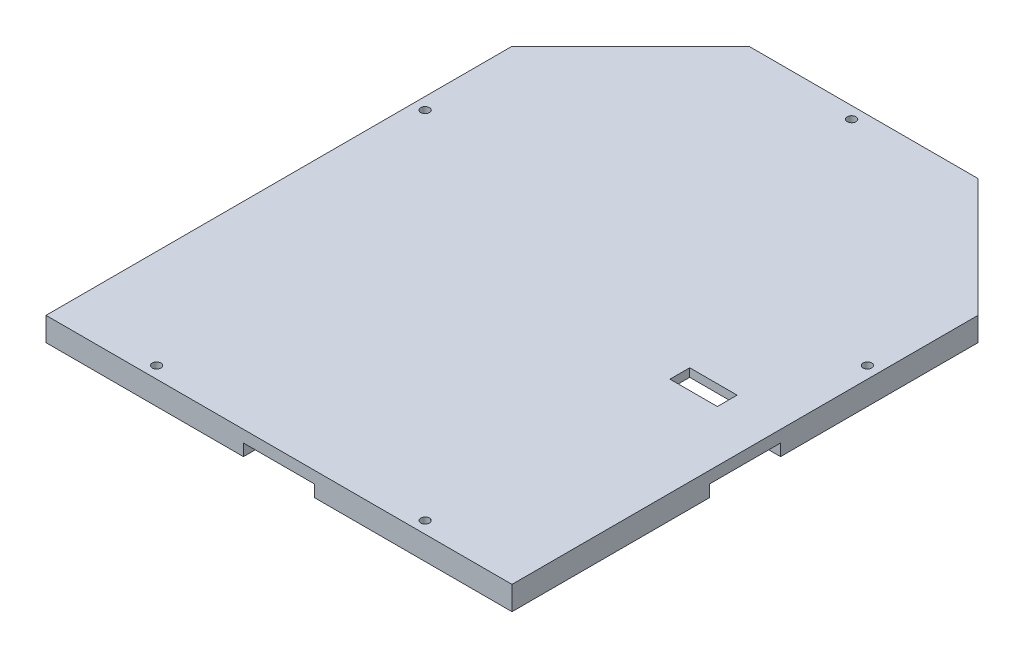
ISO-10303-21;
HEADER;
FILE_DESCRIPTION(('STEP AP214'),'2;1');
FILE_NAME('part.step','',(''),(''),'','','');
FILE_SCHEMA(('AUTOMOTIVE_DESIGN { 1 0 10303 214 1 1 1 1 }'));
ENDSEC;
DATA;
#1=APPLICATION_CONTEXT('core data for automotive mechanical design processes');
#2=APPLICATION_PROTOCOL_DEFINITION('international standard','automotive_design',2000,#1);
#3=PRODUCT_CONTEXT('',#1,'mechanical');
#4=PRODUCT('Part','Part','',(#3));
#5=PRODUCT_RELATED_PRODUCT_CATEGORY('part','',(#4));
#6=PRODUCT_DEFINITION_FORMATION('','',#4);
#7=PRODUCT_DEFINITION_CONTEXT('part definition',#1,'design');
#8=PRODUCT_DEFINITION('design','',#6,#7);
#9=PRODUCT_DEFINITION_SHAPE('','',#8);
#10=(LENGTH_UNIT() NAMED_UNIT(*) SI_UNIT(.MILLI.,.METRE.));
#11=(NAMED_UNIT(*) PLANE_ANGLE_UNIT() SI_UNIT($,.RADIAN.));
#12=(NAMED_UNIT(*) SI_UNIT($,.STERADIAN.) SOLID_ANGLE_UNIT());
#13=UNCERTAINTY_MEASURE_WITH_UNIT(LENGTH_MEASURE(1.E-05),#10,'distance_accuracy_value','');
#14=(GEOMETRIC_REPRESENTATION_CONTEXT(3) GLOBAL_UNCERTAINTY_ASSIGNED_CONTEXT((#13)) GLOBAL_UNIT_ASSIGNED_CONTEXT((#10,
#11,#12)) REPRESENTATION_CONTEXT('',''));
#15=CARTESIAN_POINT('',(0.,0.,0.));
#16=DIRECTION('',(0.,0.,1.));
#17=DIRECTION('',(1.,0.,0.));
#18=AXIS2_PLACEMENT_3D('',#15,#16,#17);
#19=CARTESIAN_POINT('',(34.,6.,-5.99999999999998));
#20=DIRECTION('',(1.,0.,0.));
#21=DIRECTION('',(0.,0.,-1.));
#22=AXIS2_PLACEMENT_3D('',#19,#20,#21);
#23=PLANE('',#22);
#24=DIRECTION('',(0.,-1.,0.));
#25=VECTOR('',#24,1.);
#26=CARTESIAN_POINT('',(34.,6.,-5.99999999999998));
#27=LINE('',#26,#25);
#28=CARTESIAN_POINT('',(34.,6.,-5.99999999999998));
#29=VERTEX_POINT('',#28);
#30=CARTESIAN_POINT('',(34.,3.9,-5.99999999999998));
#31=VERTEX_POINT('',#30);
#32=EDGE_CURVE('E517',#29,#31,#27,.T.);
#33=ORIENTED_EDGE('',*,*,#32,.T.);
#34=DIRECTION('',(0.,0.,-1.));
#35=VECTOR('',#34,1.);
#36=CARTESIAN_POINT('',(34.,3.9,-5.99999999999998));
#37=LINE('',#36,#35);
#38=CARTESIAN_POINT('',(34.,3.9,-11.));
#39=VERTEX_POINT('',#38);
#40=EDGE_CURVE('E356',#31,#39,#37,.T.);
#41=ORIENTED_EDGE('',*,*,#40,.T.);
#42=DIRECTION('',(0.,-1.,0.));
#43=VECTOR('',#42,1.);
#44=CARTESIAN_POINT('',(34.,6.,-11.));
#45=LINE('',#44,#43);
#46=CARTESIAN_POINT('',(34.,6.,-11.));
#47=VERTEX_POINT('',#46);
#48=EDGE_CURVE('E508',#47,#39,#45,.T.);
#49=ORIENTED_EDGE('',*,*,#48,.F.);
#50=DIRECTION('',(0.,0.,1.));
#51=VECTOR('',#50,1.);
#52=CARTESIAN_POINT('',(34.,6.,-5.99999999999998));
#53=LINE('',#52,#51);
#54=EDGE_CURVE('E499',#47,#29,#53,.T.);
#55=ORIENTED_EDGE('',*,*,#54,.T.);
#56=EDGE_LOOP('',(#33,#41,#49,#55));
#57=FACE_BOUND('',#56,.T.);
#58=ADVANCED_FACE('F33',(#57),#23,.T.);
#59=CARTESIAN_POINT('',(34.,6.,-5.99999999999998));
#60=DIRECTION('',(0.,0.,-1.));
#61=DIRECTION('',(-1.,0.,0.));
#62=AXIS2_PLACEMENT_3D('',#59,#60,#61);
#63=PLANE('',#62);
#64=DIRECTION('',(0.,-1.,0.));
#65=VECTOR('',#64,1.);
#66=CARTESIAN_POINT('',(46.,6.,-5.99999999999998));
#67=LINE('',#66,#65);
#68=CARTESIAN_POINT('',(46.,6.,-5.99999999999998));
#69=VERTEX_POINT('',#68);
#70=CARTESIAN_POINT('',(46.,3.9,-5.99999999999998));
#71=VERTEX_POINT('',#70);
#72=EDGE_CURVE('E514',#69,#71,#67,.T.);
#73=ORIENTED_EDGE('',*,*,#72,.T.);
#74=DIRECTION('',(-1.,0.,0.));
#75=VECTOR('',#74,1.);
#76=CARTESIAN_POINT('',(34.,3.9,-5.99999999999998));
#77=LINE('',#76,#75);
#78=EDGE_CURVE('E353',#71,#31,#77,.T.);
#79=ORIENTED_EDGE('',*,*,#78,.T.);
#80=ORIENTED_EDGE('',*,*,#32,.F.);
#81=DIRECTION('',(1.,0.,0.));
#82=VECTOR('',#81,1.);
#83=CARTESIAN_POINT('',(34.,6.,-5.99999999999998));
#84=LINE('',#83,#82);
#85=EDGE_CURVE('E501',#29,#69,#84,.T.);
#86=ORIENTED_EDGE('',*,*,#85,.T.);
#87=EDGE_LOOP('',(#73,#79,#80,#86));
#88=FACE_BOUND('',#87,.T.);
#89=ADVANCED_FACE('F674',(#88),#63,.T.);
#90=CARTESIAN_POINT('',(46.,6.,-5.99999999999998));
#91=DIRECTION('',(-1.,0.,0.));
#92=DIRECTION('',(0.,0.,1.));
#93=AXIS2_PLACEMENT_3D('',#90,#91,#92);
#94=PLANE('',#93);
#95=DIRECTION('',(0.,-1.,0.));
#96=VECTOR('',#95,1.);
#97=CARTESIAN_POINT('',(46.,6.,-11.));
#98=LINE('',#97,#96);
#99=CARTESIAN_POINT('',(46.,6.,-11.));
#100=VERTEX_POINT('',#99);
#101=CARTESIAN_POINT('',(46.,3.9,-11.));
#102=VERTEX_POINT('',#101);
#103=EDGE_CURVE('E511',#100,#102,#98,.T.);
#104=ORIENTED_EDGE('',*,*,#103,.T.);
#105=DIRECTION('',(0.,0.,1.));
#106=VECTOR('',#105,1.);
#107=CARTESIAN_POINT('',(46.,3.9,-5.99999999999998));
#108=LINE('',#107,#106);
#109=EDGE_CURVE('E48',#102,#71,#108,.T.);
#110=ORIENTED_EDGE('',*,*,#109,.T.);
#111=ORIENTED_EDGE('',*,*,#72,.F.);
#112=DIRECTION('',(0.,0.,-1.));
#113=VECTOR('',#112,1.);
#114=CARTESIAN_POINT('',(46.,6.,-5.99999999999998));
#115=LINE('',#114,#113);
#116=EDGE_CURVE('E503',#69,#100,#115,.T.);
#117=ORIENTED_EDGE('',*,*,#116,.T.);
#118=EDGE_LOOP('',(#104,#110,#111,#117));
#119=FACE_BOUND('',#118,.T.);
#120=ADVANCED_FACE('F680',(#119),#94,.T.);
#121=CARTESIAN_POINT('',(34.,6.,-11.));
#122=DIRECTION('',(0.,0.,1.));
#123=DIRECTION('',(1.,0.,0.));
#124=AXIS2_PLACEMENT_3D('',#121,#122,#123);
#125=PLANE('',#124);
#126=ORIENTED_EDGE('',*,*,#48,.T.);
#127=DIRECTION('',(1.,0.,0.));
#128=VECTOR('',#127,1.);
#129=CARTESIAN_POINT('',(34.,3.9,-11.));
#130=LINE('',#129,#128);
#131=EDGE_CURVE('E11',#39,#102,#130,.T.);
#132=ORIENTED_EDGE('',*,*,#131,.T.);
#133=ORIENTED_EDGE('',*,*,#103,.F.);
#134=DIRECTION('',(-1.,0.,0.));
#135=VECTOR('',#134,1.);
#136=CARTESIAN_POINT('',(34.,6.,-11.));
#137=LINE('',#136,#135);
#138=EDGE_CURVE('E506',#100,#47,#137,.T.);
#139=ORIENTED_EDGE('',*,*,#138,.T.);
#140=EDGE_LOOP('',(#126,#132,#133,#139));
#141=FACE_BOUND('',#140,.T.);
#142=ADVANCED_FACE('F860',(#141),#125,.T.);
#143=CARTESIAN_POINT('',(2.,2.,45.7301515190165));
#144=DIRECTION('',(-1.,0.,0.));
#145=DIRECTION('',(0.,0.,1.));
#146=AXIS2_PLACEMENT_3D('',#143,#144,#145);
#147=PLANE('',#146);
#148=DIRECTION('',(0.,0.,-1.));
#149=VECTOR('',#148,1.);
#150=CARTESIAN_POINT('',(2.,2.,45.7301515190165));
#151=LINE('',#150,#149);
#152=CARTESIAN_POINT('',(2.,2.,-14.8));
#153=VERTEX_POINT('',#152);
#154=CARTESIAN_POINT('',(2.,2.,-24.8));
#155=VERTEX_POINT('',#154);
#156=EDGE_CURVE('E366',#153,#155,#151,.T.);
#157=ORIENTED_EDGE('',*,*,#156,.F.);
#158=DIRECTION('',(0.,-1.,0.));
#159=VECTOR('',#158,1.);
#160=CARTESIAN_POINT('',(2.,3.9,-14.8));
#161=LINE('',#160,#159);
#162=CARTESIAN_POINT('',(2.,0.,-14.8));
#163=VERTEX_POINT('',#162);
#164=EDGE_CURVE('E339',#153,#163,#161,.T.);
#165=ORIENTED_EDGE('',*,*,#164,.T.);
#166=DIRECTION('',(0.,0.,-1.));
#167=VECTOR('',#166,1.);
#168=CARTESIAN_POINT('',(2.,0.,45.7301515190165));
#169=LINE('',#168,#167);
#170=CARTESIAN_POINT('',(2.,0.,-24.8));
#171=VERTEX_POINT('',#170);
#172=EDGE_CURVE('E381',#163,#171,#169,.T.);
#173=ORIENTED_EDGE('',*,*,#172,.T.);
#174=DIRECTION('',(0.,-1.,0.));
#175=VECTOR('',#174,1.);
#176=CARTESIAN_POINT('',(2.,2.,-24.8));
#177=LINE('',#176,#175);
#178=EDGE_CURVE('E301',#155,#171,#177,.T.);
#179=ORIENTED_EDGE('',*,*,#178,.F.);
#180=EDGE_LOOP('',(#157,#165,#173,#179));
#181=FACE_BOUND('',#180,.T.);
#182=ADVANCED_FACE('F657',(#181),#147,.F.);
#183=CARTESIAN_POINT('',(51.,2.,45.7301515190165));
#184=DIRECTION('',(1.,0.,0.));
#185=DIRECTION('',(0.,0.,-1.));
#186=AXIS2_PLACEMENT_3D('',#183,#184,#185);
#187=PLANE('',#186);
#188=DIRECTION('',(0.,-1.,0.));
#189=VECTOR('',#188,1.);
#190=CARTESIAN_POINT('',(51.,2.,45.7301515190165));
#191=LINE('',#190,#189);
#192=CARTESIAN_POINT('',(51.,3.9,45.7301515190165));
#193=VERTEX_POINT('',#192);
#194=CARTESIAN_POINT('',(51.,0.,45.7301515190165));
#195=VERTEX_POINT('',#194);
#196=EDGE_CURVE('E388',#193,#195,#191,.T.);
#197=ORIENTED_EDGE('',*,*,#196,.F.);
#198=DIRECTION('',(0.,0.,1.));
#199=VECTOR('',#198,1.);
#200=CARTESIAN_POINT('',(51.,3.9,-11.8301515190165));
#201=LINE('',#200,#199);
#202=CARTESIAN_POINT('',(51.,3.9,-11.8301515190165));
#203=VERTEX_POINT('',#202);
#204=EDGE_CURVE('E330',#203,#193,#201,.T.);
#205=ORIENTED_EDGE('',*,*,#204,.F.);
#206=DIRECTION('',(0.,-1.,0.));
#207=VECTOR('',#206,1.);
#208=CARTESIAN_POINT('',(51.,3.9,-11.8301515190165));
#209=LINE('',#208,#207);
#210=CARTESIAN_POINT('',(51.,0.,-11.8301515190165));
#211=VERTEX_POINT('',#210);
#212=EDGE_CURVE('E337',#203,#211,#209,.T.);
#213=ORIENTED_EDGE('',*,*,#212,.T.);
#214=DIRECTION('',(0.,0.,1.));
#215=VECTOR('',#214,1.);
#216=CARTESIAN_POINT('',(51.,0.,45.7301515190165));
#217=LINE('',#216,#215);
#218=EDGE_CURVE('E370',#211,#195,#217,.T.);
#219=ORIENTED_EDGE('',*,*,#218,.T.);
#220=EDGE_LOOP('',(#197,#205,#213,#219));
#221=FACE_BOUND('',#220,.T.);
#222=ADVANCED_FACE('F647',(#221),#187,.F.);
#223=CARTESIAN_POINT('',(0.,0.,0.));
#224=DIRECTION('',(0.,1.,0.));
#225=DIRECTION('',(0.,0.,1.));
#226=AXIS2_PLACEMENT_3D('',#223,#224,#225);
#227=PLANE('',#226);
#228=ORIENTED_EDGE('',*,*,#218,.F.);
#229=CARTESIAN_POINT('',(49.5150757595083,0.,-13.3150757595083));
#230=DIRECTION('',(0.,-1.,0.));
#231=DIRECTION('',(0.,0.,-1.));
#232=AXIS2_PLACEMENT_3D('',#229,#230,#231);
#233=CIRCLE('',#232,2.10000000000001);
#234=CARTESIAN_POINT('',(51.,0.,-14.8));
#235=VERTEX_POINT('',#234);
#236=EDGE_CURVE('E317',#235,#211,#233,.T.);
#237=ORIENTED_EDGE('',*,*,#236,.F.);
#238=CARTESIAN_POINT('',(51.,0.,-24.8));
#239=VERTEX_POINT('',#238);
#240=EDGE_CURVE('E371',#239,#235,#217,.T.);
#241=ORIENTED_EDGE('',*,*,#240,.F.);
#242=DIRECTION('',(1.,0.,0.));
#243=VECTOR('',#242,1.);
#244=CARTESIAN_POINT('',(2.,0.,-24.8));
#245=LINE('',#244,#243);
#246=EDGE_CURVE('E55',#171,#239,#245,.T.);
#247=ORIENTED_EDGE('',*,*,#246,.F.);
#248=ORIENTED_EDGE('',*,*,#172,.F.);
#249=CARTESIAN_POINT('',(3.48492424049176,0.,-13.3150757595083));
#250=DIRECTION('',(0.,-1.,0.));
#251=DIRECTION('',(0.,0.,1.));
#252=AXIS2_PLACEMENT_3D('',#249,#250,#251);
#253=CIRCLE('',#252,2.1);
#254=CARTESIAN_POINT('',(2.,0.,-11.8301515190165));
#255=VERTEX_POINT('',#254);
#256=EDGE_CURVE('E320',#255,#163,#253,.T.);
#257=ORIENTED_EDGE('',*,*,#256,.F.);
#258=CARTESIAN_POINT('',(2.,0.,45.7301515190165));
#259=VERTEX_POINT('',#258);
#260=EDGE_CURVE('E363',#259,#255,#169,.T.);
#261=ORIENTED_EDGE('',*,*,#260,.F.);
#262=CARTESIAN_POINT('',(3.48492424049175,0.,47.2150757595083));
#263=DIRECTION('',(0.,-1.,0.));
#264=DIRECTION('',(0.,0.,-1.));
#265=AXIS2_PLACEMENT_3D('',#262,#263,#264);
#266=CIRCLE('',#265,2.1);
#267=CARTESIAN_POINT('',(4.96984848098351,0.,48.7));
#268=VERTEX_POINT('',#267);
#269=EDGE_CURVE('E297',#268,#259,#266,.T.);
#270=ORIENTED_EDGE('',*,*,#269,.F.);
#271=DIRECTION('',(-1.,0.,0.));
#272=VECTOR('',#271,1.);
#273=CARTESIAN_POINT('',(4.96984848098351,0.,48.7));
#274=LINE('',#273,#272);
#275=CARTESIAN_POINT('',(48.0301515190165,0.,48.7));
#276=VERTEX_POINT('',#275);
#277=EDGE_CURVE('E377',#276,#268,#274,.T.);
#278=ORIENTED_EDGE('',*,*,#277,.F.);
#279=CARTESIAN_POINT('',(49.5150757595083,0.,47.2150757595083));
#280=DIRECTION('',(0.,-1.,0.));
#281=DIRECTION('',(0.,0.,1.));
#282=AXIS2_PLACEMENT_3D('',#279,#280,#281);
#283=CIRCLE('',#282,2.10000000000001);
#284=EDGE_CURVE('E374',#195,#276,#283,.T.);
#285=ORIENTED_EDGE('',*,*,#284,.F.);
#286=EDGE_LOOP('',(#228,#237,#241,#247,#248,#257,#261,#270,#278,#285));
#287=FACE_BOUND('',#286,.T.);
#288=CARTESIAN_POINT('',(-56.,0.,-34.));
#289=DIRECTION('',(0.,1.,0.));
#290=DIRECTION('',(0.,0.,1.));
#291=AXIS2_PLACEMENT_3D('',#288,#289,#290);
#292=CIRCLE('',#291,1.1);
#293=CARTESIAN_POINT('',(-56.,0.,-32.9));
#294=VERTEX_POINT('',#293);
#295=EDGE_CURVE('E542',#294,#294,#292,.T.);
#296=ORIENTED_EDGE('',*,*,#295,.T.);
#297=EDGE_LOOP('',(#296));
#298=FACE_BOUND('',#297,.T.);
#299=CARTESIAN_POINT('',(33.9999999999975,0.,55.9999999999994));
#300=DIRECTION('',(0.,1.,0.));
#301=DIRECTION('',(0.,0.,-1.));
#302=AXIS2_PLACEMENT_3D('',#299,#300,#301);
#303=CIRCLE('',#302,1.10000000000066);
#304=CARTESIAN_POINT('',(33.9999999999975,0.,54.8999999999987));
#305=VERTEX_POINT('',#304);
#306=EDGE_CURVE('E536',#305,#305,#303,.T.);
#307=ORIENTED_EDGE('',*,*,#306,.T.);
#308=EDGE_LOOP('',(#307));
#309=FACE_BOUND('',#308,.T.);
#310=CARTESIAN_POINT('',(56.,0.,-34.));
#311=DIRECTION('',(0.,1.,0.));
#312=DIRECTION('',(0.,0.,-1.));
#313=AXIS2_PLACEMENT_3D('',#310,#311,#312);
#314=CIRCLE('',#313,1.1);
#315=CARTESIAN_POINT('',(56.,0.,-35.1));
#316=VERTEX_POINT('',#315);
#317=EDGE_CURVE('E530',#316,#316,#314,.T.);
#318=ORIENTED_EDGE('',*,*,#317,.T.);
#319=EDGE_LOOP('',(#318));
#320=FACE_BOUND('',#319,.T.);
#321=CARTESIAN_POINT('',(-33.9999999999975,0.,55.9999999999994));
#322=DIRECTION('',(0.,1.,0.));
#323=DIRECTION('',(0.,0.,1.));
#324=AXIS2_PLACEMENT_3D('',#321,#322,#323);
#325=CIRCLE('',#324,1.10000000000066);
#326=CARTESIAN_POINT('',(-33.9999999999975,0.,57.1));
#327=VERTEX_POINT('',#326);
#328=EDGE_CURVE('E524',#327,#327,#325,.T.);
#329=ORIENTED_EDGE('',*,*,#328,.T.);
#330=EDGE_LOOP('',(#329));
#331=FACE_BOUND('',#330,.T.);
#332=CARTESIAN_POINT('',(0.,0.,-86.));
#333=DIRECTION('',(0.,1.,0.));
#334=DIRECTION('',(0.,0.,1.));
#335=AXIS2_PLACEMENT_3D('',#332,#333,#334);
#336=CIRCLE('',#335,1.1);
#337=CARTESIAN_POINT('',(0.,0.,-84.9));
#338=VERTEX_POINT('',#337);
#339=EDGE_CURVE('E520',#338,#338,#336,.T.);
#340=ORIENTED_EDGE('',*,*,#339,.T.);
#341=EDGE_LOOP('',(#340));
#342=FACE_BOUND('',#341,.T.);
#343=DIRECTION('',(-1.,0.,0.));
#344=VECTOR('',#343,1.);
#345=CARTESIAN_POINT('',(-55.2627416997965,0.,-9.00000000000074));
#346=LINE('',#345,#344);
#347=CARTESIAN_POINT('',(-55.2627416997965,0.,-9.00000000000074));
#348=VERTEX_POINT('',#347);
#349=CARTESIAN_POINT('',(-59.,0.,-9.00000000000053));
#350=VERTEX_POINT('',#349);
#351=EDGE_CURVE('E414',#348,#350,#346,.T.);
#352=ORIENTED_EDGE('',*,*,#351,.T.);
#353=DIRECTION('',(0.,0.,1.));
#354=VECTOR('',#353,1.);
#355=CARTESIAN_POINT('',(-59.,0.,-59.));
#356=LINE('',#355,#354);
#357=CARTESIAN_POINT('',(-59.,0.,-59.));
#358=VERTEX_POINT('',#357);
#359=EDGE_CURVE('E576',#358,#350,#356,.T.);
#360=ORIENTED_EDGE('',*,*,#359,.F.);
#361=DIRECTION('',(-0.707106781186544,0.,0.707106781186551));
#362=VECTOR('',#361,1.);
#363=CARTESIAN_POINT('',(-59.,0.,-59.));
#364=LINE('',#363,#362);
#365=CARTESIAN_POINT('',(-29.0000000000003,0.,-89.));
#366=VERTEX_POINT('',#365);
#367=EDGE_CURVE('E573',#366,#358,#364,.T.);
#368=ORIENTED_EDGE('',*,*,#367,.F.);
#369=DIRECTION('',(-1.,0.,0.));
#370=VECTOR('',#369,1.);
#371=CARTESIAN_POINT('',(-29.0000000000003,0.,-89.));
#372=LINE('',#371,#370);
#373=CARTESIAN_POINT('',(29.0000000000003,0.,-89.));
#374=VERTEX_POINT('',#373);
#375=EDGE_CURVE('E571',#374,#366,#372,.T.);
#376=ORIENTED_EDGE('',*,*,#375,.F.);
#377=DIRECTION('',(-0.707106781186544,0.,-0.707106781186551));
#378=VECTOR('',#377,1.);
#379=CARTESIAN_POINT('',(59.,0.,-59.));
#380=LINE('',#379,#378);
#381=CARTESIAN_POINT('',(59.,0.,-59.));
#382=VERTEX_POINT('',#381);
#383=EDGE_CURVE('E569',#382,#374,#380,.T.);
#384=ORIENTED_EDGE('',*,*,#383,.F.);
#385=DIRECTION('',(0.,0.,-1.));
#386=VECTOR('',#385,1.);
#387=CARTESIAN_POINT('',(59.,0.,-59.));
#388=LINE('',#387,#386);
#389=CARTESIAN_POINT('',(59.,0.,-9.));
#390=VERTEX_POINT('',#389);
#391=EDGE_CURVE('E548',#390,#382,#388,.T.);
#392=ORIENTED_EDGE('',*,*,#391,.F.);
#393=DIRECTION('',(-1.,0.,0.));
#394=VECTOR('',#393,1.);
#395=CARTESIAN_POINT('',(55.2627416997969,0.,-9.));
#396=LINE('',#395,#394);
#397=CARTESIAN_POINT('',(55.2627416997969,0.,-9.));
#398=VERTEX_POINT('',#397);
#399=EDGE_CURVE('E468',#390,#398,#396,.T.);
#400=ORIENTED_EDGE('',*,*,#399,.T.);
#401=CARTESIAN_POINT('',(54.1313708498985,0.,-7.86862915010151));
#402=DIRECTION('',(0.,1.,0.));
#403=DIRECTION('',(0.,0.,1.));
#404=AXIS2_PLACEMENT_3D('',#401,#402,#403);
#405=CIRCLE('',#404,1.6);
#406=CARTESIAN_POINT('',(53.,0.,-6.73725830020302));
#407=VERTEX_POINT('',#406);
#408=EDGE_CURVE('E463',#398,#407,#405,.T.);
#409=ORIENTED_EDGE('',*,*,#408,.T.);
#410=DIRECTION('',(0.,0.,1.));
#411=VECTOR('',#410,1.);
#412=CARTESIAN_POINT('',(53.,0.,-6.73725830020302));
#413=LINE('',#412,#411);
#414=CARTESIAN_POINT('',(53.,0.,6.73725830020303));
#415=VERTEX_POINT('',#414);
#416=EDGE_CURVE('E480',#407,#415,#413,.T.);
#417=ORIENTED_EDGE('',*,*,#416,.T.);
#418=CARTESIAN_POINT('',(54.1313708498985,0.,7.86862915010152));
#419=DIRECTION('',(0.,1.,0.));
#420=DIRECTION('',(0.,0.,-1.));
#421=AXIS2_PLACEMENT_3D('',#418,#419,#420);
#422=CIRCLE('',#421,1.6);
#423=CARTESIAN_POINT('',(55.2627416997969,0.,9.00000000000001));
#424=VERTEX_POINT('',#423);
#425=EDGE_CURVE('E483',#415,#424,#422,.T.);
#426=ORIENTED_EDGE('',*,*,#425,.T.);
#427=DIRECTION('',(1.,0.,0.));
#428=VECTOR('',#427,1.);
#429=CARTESIAN_POINT('',(55.2627416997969,0.,9.00000000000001));
#430=LINE('',#429,#428);
#431=CARTESIAN_POINT('',(59.,0.,9.));
#432=VERTEX_POINT('',#431);
#433=EDGE_CURVE('E486',#424,#432,#430,.T.);
#434=ORIENTED_EDGE('',*,*,#433,.T.);
#435=CARTESIAN_POINT('',(59.,0.,59.));
#436=VERTEX_POINT('',#435);
#437=EDGE_CURVE('E566',#436,#432,#388,.T.);
#438=ORIENTED_EDGE('',*,*,#437,.F.);
#439=DIRECTION('',(1.,0.,0.));
#440=VECTOR('',#439,1.);
#441=CARTESIAN_POINT('',(-59.,0.,59.));
#442=LINE('',#441,#440);
#443=CARTESIAN_POINT('',(8.9999999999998,0.,59.));
#444=VERTEX_POINT('',#443);
#445=EDGE_CURVE('E579',#444,#436,#442,.T.);
#446=ORIENTED_EDGE('',*,*,#445,.F.);
#447=DIRECTION('',(0.,0.,-1.));
#448=VECTOR('',#447,1.);
#449=CARTESIAN_POINT('',(8.99999999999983,0.,55.2627416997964));
#450=LINE('',#449,#448);
#451=CARTESIAN_POINT('',(8.99999999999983,0.,55.2627416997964));
#452=VERTEX_POINT('',#451);
#453=EDGE_CURVE('E432',#444,#452,#450,.T.);
#454=ORIENTED_EDGE('',*,*,#453,.T.);
#455=CARTESIAN_POINT('',(7.86862915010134,0.,54.1313708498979));
#456=DIRECTION('',(0.,1.,0.));
#457=DIRECTION('',(0.,0.,1.));
#458=AXIS2_PLACEMENT_3D('',#455,#456,#457);
#459=CIRCLE('',#458,1.6);
#460=CARTESIAN_POINT('',(6.73725830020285,0.,52.9999999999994));
#461=VERTEX_POINT('',#460);
#462=EDGE_CURVE('E427',#452,#461,#459,.T.);
#463=ORIENTED_EDGE('',*,*,#462,.T.);
#464=DIRECTION('',(-1.,0.,0.));
#465=VECTOR('',#464,1.);
#466=CARTESIAN_POINT('',(6.73725830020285,0.,52.9999999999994));
#467=LINE('',#466,#465);
#468=CARTESIAN_POINT('',(-6.7372583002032,0.,52.9999999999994));
#469=VERTEX_POINT('',#468);
#470=EDGE_CURVE('E444',#461,#469,#467,.T.);
#471=ORIENTED_EDGE('',*,*,#470,.T.);
#472=CARTESIAN_POINT('',(-7.86862915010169,0.,54.1313708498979));
#473=DIRECTION('',(0.,1.,0.));
#474=DIRECTION('',(0.,0.,-1.));
#475=AXIS2_PLACEMENT_3D('',#472,#473,#474);
#476=CIRCLE('',#475,1.6);
#477=CARTESIAN_POINT('',(-9.00000000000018,0.,55.2627416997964));
#478=VERTEX_POINT('',#477);
#479=EDGE_CURVE('E447',#469,#478,#476,.T.);
#480=ORIENTED_EDGE('',*,*,#479,.T.);
#481=DIRECTION('',(0.,0.,1.));
#482=VECTOR('',#481,1.);
#483=CARTESIAN_POINT('',(-9.00000000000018,0.,55.2627416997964));
#484=LINE('',#483,#482);
#485=CARTESIAN_POINT('',(-9.0000000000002,0.,59.));
#486=VERTEX_POINT('',#485);
#487=EDGE_CURVE('E450',#478,#486,#484,.T.);
#488=ORIENTED_EDGE('',*,*,#487,.T.);
#489=CARTESIAN_POINT('',(-59.,0.,59.));
#490=VERTEX_POINT('',#489);
#491=EDGE_CURVE('E555',#490,#486,#442,.T.);
#492=ORIENTED_EDGE('',*,*,#491,.F.);
#493=CARTESIAN_POINT('',(-59.,0.,8.99999999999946));
#494=VERTEX_POINT('',#493);
#495=EDGE_CURVE('E575',#494,#490,#356,.T.);
#496=ORIENTED_EDGE('',*,*,#495,.F.);
#497=DIRECTION('',(1.,0.,0.));
#498=VECTOR('',#497,1.);
#499=CARTESIAN_POINT('',(-55.2627416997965,0.,8.99999999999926));
#500=LINE('',#499,#498);
#501=CARTESIAN_POINT('',(-55.2627416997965,0.,8.99999999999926));
#502=VERTEX_POINT('',#501);
#503=EDGE_CURVE('E396',#494,#502,#500,.T.);
#504=ORIENTED_EDGE('',*,*,#503,.T.);
#505=CARTESIAN_POINT('',(-54.1313708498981,0.,7.86862915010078));
#506=DIRECTION('',(0.,1.,0.));
#507=DIRECTION('',(0.,0.,1.));
#508=AXIS2_PLACEMENT_3D('',#505,#506,#507);
#509=CIRCLE('',#508,1.6);
#510=CARTESIAN_POINT('',(-52.9999999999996,0.,6.73725830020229));
#511=VERTEX_POINT('',#510);
#512=EDGE_CURVE('E383',#502,#511,#509,.T.);
#513=ORIENTED_EDGE('',*,*,#512,.T.);
#514=DIRECTION('',(0.,0.,-1.));
#515=VECTOR('',#514,1.);
#516=CARTESIAN_POINT('',(-52.9999999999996,0.,6.73725830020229));
#517=LINE('',#516,#515);
#518=CARTESIAN_POINT('',(-52.9999999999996,0.,-6.73725830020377));
#519=VERTEX_POINT('',#518);
#520=EDGE_CURVE('E408',#511,#519,#517,.T.);
#521=ORIENTED_EDGE('',*,*,#520,.T.);
#522=CARTESIAN_POINT('',(-54.1313708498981,0.,-7.86862915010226));
#523=DIRECTION('',(0.,1.,0.));
#524=DIRECTION('',(0.,0.,-1.));
#525=AXIS2_PLACEMENT_3D('',#522,#523,#524);
#526=CIRCLE('',#525,1.6);
#527=EDGE_CURVE('E411',#519,#348,#526,.T.);
#528=ORIENTED_EDGE('',*,*,#527,.T.);
#529=EDGE_LOOP('',(#352,#360,#368,#376,#384,#392,#400,#409,#417,#426,#434,#438,#446,#454,#463,
#471,#480,#488,#492,#496,#504,#513,#521,#528));
#530=FACE_BOUND('',#529,.T.);
#531=ADVANCED_FACE('F641',(#287,#298,#309,#320,#331,#342,#530),#227,.F.);
#532=CARTESIAN_POINT('',(-59.,6.,-59.));
#533=DIRECTION('',(1.,0.,0.));
#534=DIRECTION('',(0.,0.,-1.));
#535=AXIS2_PLACEMENT_3D('',#532,#533,#534);
#536=PLANE('',#535);
#537=DIRECTION('',(0.,-1.,0.));
#538=VECTOR('',#537,1.);
#539=CARTESIAN_POINT('',(-59.,6.,-9.00000000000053));
#540=LINE('',#539,#538);
#541=CARTESIAN_POINT('',(-59.,3.,-9.00000000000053));
#542=VERTEX_POINT('',#541);
#543=EDGE_CURVE('E621',#542,#350,#540,.T.);
#544=ORIENTED_EDGE('',*,*,#543,.F.);
#545=DIRECTION('',(0.,0.,1.));
#546=VECTOR('',#545,1.);
#547=CARTESIAN_POINT('',(-59.,3.,-59.));
#548=LINE('',#547,#546);
#549=CARTESIAN_POINT('',(-59.,3.,8.99999999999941));
#550=VERTEX_POINT('',#549);
#551=EDGE_CURVE('E615',#542,#550,#548,.T.);
#552=ORIENTED_EDGE('',*,*,#551,.T.);
#553=DIRECTION('',(0.,1.,0.));
#554=VECTOR('',#553,1.);
#555=CARTESIAN_POINT('',(-59.,6.,8.99999999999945));
#556=LINE('',#555,#554);
#557=EDGE_CURVE('E618',#494,#550,#556,.T.);
#558=ORIENTED_EDGE('',*,*,#557,.F.);
#559=ORIENTED_EDGE('',*,*,#495,.T.);
#560=DIRECTION('',(0.,-1.,0.));
#561=VECTOR('',#560,1.);
#562=CARTESIAN_POINT('',(-59.,6.,59.));
#563=LINE('',#562,#561);
#564=CARTESIAN_POINT('',(-59.,6.,59.));
#565=VERTEX_POINT('',#564);
#566=EDGE_CURVE('E584',#565,#490,#563,.T.);
#567=ORIENTED_EDGE('',*,*,#566,.F.);
#568=DIRECTION('',(0.,0.,1.));
#569=VECTOR('',#568,1.);
#570=CARTESIAN_POINT('',(-59.,6.,-59.));
#571=LINE('',#570,#569);
#572=CARTESIAN_POINT('',(-59.,6.,-59.));
#573=VERTEX_POINT('',#572);
#574=EDGE_CURVE('E561',#573,#565,#571,.T.);
#575=ORIENTED_EDGE('',*,*,#574,.F.);
#576=DIRECTION('',(0.,-1.,0.));
#577=VECTOR('',#576,1.);
#578=CARTESIAN_POINT('',(-59.,6.,-59.));
#579=LINE('',#578,#577);
#580=EDGE_CURVE('E587',#573,#358,#579,.T.);
#581=ORIENTED_EDGE('',*,*,#580,.T.);
#582=ORIENTED_EDGE('',*,*,#359,.T.);
#583=EDGE_LOOP('',(#544,#552,#558,#559,#567,#575,#581,#582));
#584=FACE_BOUND('',#583,.T.);
#585=ADVANCED_FACE('F714',(#584),#536,.F.);
#586=CARTESIAN_POINT('',(-59.,6.,59.));
#587=DIRECTION('',(0.,0.,-1.));
#588=DIRECTION('',(-1.,0.,0.));
#589=AXIS2_PLACEMENT_3D('',#586,#587,#588);
#590=PLANE('',#589);
#591=DIRECTION('',(0.,-1.,0.));
#592=VECTOR('',#591,1.);
#593=CARTESIAN_POINT('',(-9.0000000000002,6.,59.));
#594=LINE('',#593,#592);
#595=CARTESIAN_POINT('',(-9.0000000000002,3.,59.));
#596=VERTEX_POINT('',#595);
#597=EDGE_CURVE('E613',#596,#486,#594,.T.);
#598=ORIENTED_EDGE('',*,*,#597,.F.);
#599=DIRECTION('',(1.,0.,0.));
#600=VECTOR('',#599,1.);
#601=CARTESIAN_POINT('',(-59.,3.,59.));
#602=LINE('',#601,#600);
#603=CARTESIAN_POINT('',(8.9999999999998,3.,59.));
#604=VERTEX_POINT('',#603);
#605=EDGE_CURVE('E607',#596,#604,#602,.T.);
#606=ORIENTED_EDGE('',*,*,#605,.T.);
#607=DIRECTION('',(0.,1.,0.));
#608=VECTOR('',#607,1.);
#609=CARTESIAN_POINT('',(8.9999999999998,6.,59.));
#610=LINE('',#609,#608);
#611=EDGE_CURVE('E610',#444,#604,#610,.T.);
#612=ORIENTED_EDGE('',*,*,#611,.F.);
#613=ORIENTED_EDGE('',*,*,#445,.T.);
#614=DIRECTION('',(0.,-1.,0.));
#615=VECTOR('',#614,1.);
#616=CARTESIAN_POINT('',(59.,6.,59.));
#617=LINE('',#616,#615);
#618=CARTESIAN_POINT('',(59.,6.,59.));
#619=VERTEX_POINT('',#618);
#620=EDGE_CURVE('E565',#619,#436,#617,.T.);
#621=ORIENTED_EDGE('',*,*,#620,.F.);
#622=DIRECTION('',(1.,0.,0.));
#623=VECTOR('',#622,1.);
#624=CARTESIAN_POINT('',(-59.,6.,59.));
#625=LINE('',#624,#623);
#626=EDGE_CURVE('E563',#565,#619,#625,.T.);
#627=ORIENTED_EDGE('',*,*,#626,.F.);
#628=ORIENTED_EDGE('',*,*,#566,.T.);
#629=ORIENTED_EDGE('',*,*,#491,.T.);
#630=EDGE_LOOP('',(#598,#606,#612,#613,#621,#627,#628,#629));
#631=FACE_BOUND('',#630,.T.);
#632=ADVANCED_FACE('F715',(#631),#590,.F.);
#633=CARTESIAN_POINT('',(59.,6.,-59.));
#634=DIRECTION('',(-1.,0.,0.));
#635=DIRECTION('',(0.,0.,1.));
#636=AXIS2_PLACEMENT_3D('',#633,#634,#635);
#637=PLANE('',#636);
#638=DIRECTION('',(0.,-1.,0.));
#639=VECTOR('',#638,1.);
#640=CARTESIAN_POINT('',(59.,6.,9.00000000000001));
#641=LINE('',#640,#639);
#642=CARTESIAN_POINT('',(59.,3.,9.));
#643=VERTEX_POINT('',#642);
#644=EDGE_CURVE('E605',#643,#432,#641,.T.);
#645=ORIENTED_EDGE('',*,*,#644,.F.);
#646=DIRECTION('',(0.,0.,-1.));
#647=VECTOR('',#646,1.);
#648=CARTESIAN_POINT('',(59.,3.,-59.));
#649=LINE('',#648,#647);
#650=CARTESIAN_POINT('',(59.,3.,-8.99999999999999));
#651=VERTEX_POINT('',#650);
#652=EDGE_CURVE('E599',#643,#651,#649,.T.);
#653=ORIENTED_EDGE('',*,*,#652,.T.);
#654=DIRECTION('',(0.,1.,0.));
#655=VECTOR('',#654,1.);
#656=CARTESIAN_POINT('',(59.,6.,-8.99999999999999));
#657=LINE('',#656,#655);
#658=EDGE_CURVE('E602',#390,#651,#657,.T.);
#659=ORIENTED_EDGE('',*,*,#658,.F.);
#660=ORIENTED_EDGE('',*,*,#391,.T.);
#661=DIRECTION('',(0.,-1.,0.));
#662=VECTOR('',#661,1.);
#663=CARTESIAN_POINT('',(59.,6.,-59.));
#664=LINE('',#663,#662);
#665=CARTESIAN_POINT('',(59.,6.,-59.));
#666=VERTEX_POINT('',#665);
#667=EDGE_CURVE('E596',#666,#382,#664,.T.);
#668=ORIENTED_EDGE('',*,*,#667,.F.);
#669=DIRECTION('',(0.,0.,-1.));
#670=VECTOR('',#669,1.);
#671=CARTESIAN_POINT('',(59.,6.,-59.));
#672=LINE('',#671,#670);
#673=EDGE_CURVE('E551',#619,#666,#672,.T.);
#674=ORIENTED_EDGE('',*,*,#673,.F.);
#675=ORIENTED_EDGE('',*,*,#620,.T.);
#676=ORIENTED_EDGE('',*,*,#437,.T.);
#677=EDGE_LOOP('',(#645,#653,#659,#660,#668,#674,#675,#676));
#678=FACE_BOUND('',#677,.T.);
#679=ADVANCED_FACE('F35',(#678),#637,.F.);
#680=CARTESIAN_POINT('',(0.,6.,0.));
#681=DIRECTION('',(0.,1.,0.));
#682=DIRECTION('',(0.,0.,1.));
#683=AXIS2_PLACEMENT_3D('',#680,#681,#682);
#684=PLANE('',#683);
#685=CARTESIAN_POINT('',(-33.9999999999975,6.,55.9999999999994));
#686=DIRECTION('',(0.,1.,0.));
#687=DIRECTION('',(0.,0.,1.));
#688=AXIS2_PLACEMENT_3D('',#685,#686,#687);
#689=CIRCLE('',#688,1.10000000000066);
#690=CARTESIAN_POINT('',(-33.9999999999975,6.,57.1));
#691=VERTEX_POINT('',#690);
#692=EDGE_CURVE('E527',#691,#691,#689,.T.);
#693=ORIENTED_EDGE('',*,*,#692,.F.);
#694=EDGE_LOOP('',(#693));
#695=FACE_BOUND('',#694,.T.);
#696=CARTESIAN_POINT('',(33.9999999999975,6.,55.9999999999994));
#697=DIRECTION('',(0.,1.,0.));
#698=DIRECTION('',(0.,0.,-1.));
#699=AXIS2_PLACEMENT_3D('',#696,#697,#698);
#700=CIRCLE('',#699,1.10000000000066);
#701=CARTESIAN_POINT('',(33.9999999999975,6.,54.8999999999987));
#702=VERTEX_POINT('',#701);
#703=EDGE_CURVE('E539',#702,#702,#700,.T.);
#704=ORIENTED_EDGE('',*,*,#703,.F.);
#705=EDGE_LOOP('',(#704));
#706=FACE_BOUND('',#705,.T.);
#707=ORIENTED_EDGE('',*,*,#673,.T.);
#708=DIRECTION('',(-0.707106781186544,0.,-0.707106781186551));
#709=VECTOR('',#708,1.);
#710=CARTESIAN_POINT('',(59.,6.,-59.));
#711=LINE('',#710,#709);
#712=CARTESIAN_POINT('',(29.0000000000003,6.,-89.));
#713=VERTEX_POINT('',#712);
#714=EDGE_CURVE('E554',#666,#713,#711,.T.);
#715=ORIENTED_EDGE('',*,*,#714,.T.);
#716=DIRECTION('',(-1.,0.,0.));
#717=VECTOR('',#716,1.);
#718=CARTESIAN_POINT('',(-29.0000000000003,6.,-89.));
#719=LINE('',#718,#717);
#720=CARTESIAN_POINT('',(-29.0000000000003,6.,-89.));
#721=VERTEX_POINT('',#720);
#722=EDGE_CURVE('E557',#713,#721,#719,.T.);
#723=ORIENTED_EDGE('',*,*,#722,.T.);
#724=DIRECTION('',(-0.707106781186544,0.,0.707106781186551));
#725=VECTOR('',#724,1.);
#726=CARTESIAN_POINT('',(-59.,6.,-59.));
#727=LINE('',#726,#725);
#728=EDGE_CURVE('E559',#721,#573,#727,.T.);
#729=ORIENTED_EDGE('',*,*,#728,.T.);
#730=ORIENTED_EDGE('',*,*,#574,.T.);
#731=ORIENTED_EDGE('',*,*,#626,.T.);
#732=EDGE_LOOP('',(#707,#715,#723,#729,#730,#731));
#733=FACE_BOUND('',#732,.T.);
#734=CARTESIAN_POINT('',(-56.,6.,-34.));
#735=DIRECTION('',(0.,1.,0.));
#736=DIRECTION('',(0.,0.,1.));
#737=AXIS2_PLACEMENT_3D('',#734,#735,#736);
#738=CIRCLE('',#737,1.1);
#739=CARTESIAN_POINT('',(-56.,6.,-32.9));
#740=VERTEX_POINT('',#739);
#741=EDGE_CURVE('E545',#740,#740,#738,.T.);
#742=ORIENTED_EDGE('',*,*,#741,.F.);
#743=EDGE_LOOP('',(#742));
#744=FACE_BOUND('',#743,.T.);
#745=CARTESIAN_POINT('',(56.,6.,-34.));
#746=DIRECTION('',(0.,1.,0.));
#747=DIRECTION('',(0.,0.,-1.));
#748=AXIS2_PLACEMENT_3D('',#745,#746,#747);
#749=CIRCLE('',#748,1.1);
#750=CARTESIAN_POINT('',(56.,6.,-35.1));
#751=VERTEX_POINT('',#750);
#752=EDGE_CURVE('E533',#751,#751,#749,.T.);
#753=ORIENTED_EDGE('',*,*,#752,.F.);
#754=EDGE_LOOP('',(#753));
#755=FACE_BOUND('',#754,.T.);
#756=CARTESIAN_POINT('',(0.,6.,-86.));
#757=DIRECTION('',(0.,1.,0.));
#758=DIRECTION('',(0.,0.,1.));
#759=AXIS2_PLACEMENT_3D('',#756,#757,#758);
#760=CIRCLE('',#759,1.1);
#761=CARTESIAN_POINT('',(0.,6.,-84.9));
#762=VERTEX_POINT('',#761);
#763=EDGE_CURVE('E521',#762,#762,#760,.T.);
#764=ORIENTED_EDGE('',*,*,#763,.F.);
#765=EDGE_LOOP('',(#764));
#766=FACE_BOUND('',#765,.T.);
#767=ORIENTED_EDGE('',*,*,#85,.F.);
#768=ORIENTED_EDGE('',*,*,#54,.F.);
#769=ORIENTED_EDGE('',*,*,#138,.F.);
#770=ORIENTED_EDGE('',*,*,#116,.F.);
#771=EDGE_LOOP('',(#767,#768,#769,#770));
#772=FACE_BOUND('',#771,.T.);
#773=ADVANCED_FACE('F707',(#695,#706,#733,#744,#755,#766,#772),#684,.T.);
#774=CARTESIAN_POINT('',(59.,6.,-59.));
#775=DIRECTION('',(-0.707106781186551,0.,0.707106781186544));
#776=DIRECTION('',(0.707106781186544,0.,0.707106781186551));
#777=AXIS2_PLACEMENT_3D('',#774,#775,#776);
#778=PLANE('',#777);
#779=ORIENTED_EDGE('',*,*,#383,.T.);
#780=DIRECTION('',(0.,-1.,0.));
#781=VECTOR('',#780,1.);
#782=CARTESIAN_POINT('',(29.0000000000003,6.,-89.));
#783=LINE('',#782,#781);
#784=EDGE_CURVE('E593',#713,#374,#783,.T.);
#785=ORIENTED_EDGE('',*,*,#784,.F.);
#786=ORIENTED_EDGE('',*,*,#714,.F.);
#787=ORIENTED_EDGE('',*,*,#667,.T.);
#788=EDGE_LOOP('',(#779,#785,#786,#787));
#789=FACE_BOUND('',#788,.T.);
#790=ADVANCED_FACE('F710',(#789),#778,.F.);
#791=CARTESIAN_POINT('',(-29.0000000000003,6.,-89.));
#792=DIRECTION('',(0.,0.,1.));
#793=DIRECTION('',(1.,0.,0.));
#794=AXIS2_PLACEMENT_3D('',#791,#792,#793);
#795=PLANE('',#794);
#796=ORIENTED_EDGE('',*,*,#375,.T.);
#797=DIRECTION('',(0.,-1.,0.));
#798=VECTOR('',#797,1.);
#799=CARTESIAN_POINT('',(-29.0000000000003,6.,-89.));
#800=LINE('',#799,#798);
#801=EDGE_CURVE('E590',#721,#366,#800,.T.);
#802=ORIENTED_EDGE('',*,*,#801,.F.);
#803=ORIENTED_EDGE('',*,*,#722,.F.);
#804=ORIENTED_EDGE('',*,*,#784,.T.);
#805=EDGE_LOOP('',(#796,#802,#803,#804));
#806=FACE_BOUND('',#805,.T.);
#807=ADVANCED_FACE('F724',(#806),#795,.F.);
#808=CARTESIAN_POINT('',(-59.,6.,-59.));
#809=DIRECTION('',(0.707106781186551,0.,0.707106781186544));
#810=DIRECTION('',(0.707106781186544,0.,-0.707106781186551));
#811=AXIS2_PLACEMENT_3D('',#808,#809,#810);
#812=PLANE('',#811);
#813=ORIENTED_EDGE('',*,*,#367,.T.);
#814=ORIENTED_EDGE('',*,*,#580,.F.);
#815=ORIENTED_EDGE('',*,*,#728,.F.);
#816=ORIENTED_EDGE('',*,*,#801,.T.);
#817=EDGE_LOOP('',(#813,#814,#815,#816));
#818=FACE_BOUND('',#817,.T.);
#819=ADVANCED_FACE('F705',(#818),#812,.F.);
#820=CARTESIAN_POINT('',(-56.,6.,-34.));
#821=DIRECTION('',(0.,-1.,0.));
#822=DIRECTION('',(0.,0.,-1.));
#823=AXIS2_PLACEMENT_3D('',#820,#821,#822);
#824=CYLINDRICAL_SURFACE('',#823,1.1);
#825=ORIENTED_EDGE('',*,*,#741,.T.);
#826=EDGE_LOOP('',(#825));
#827=FACE_BOUND('',#826,.T.);
#828=ORIENTED_EDGE('',*,*,#295,.F.);
#829=EDGE_LOOP('',(#828));
#830=FACE_BOUND('',#829,.T.);
#831=ADVANCED_FACE('F701',(#827,#830),#824,.F.);
#832=CARTESIAN_POINT('',(33.9999999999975,6.,55.9999999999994));
#833=DIRECTION('',(0.,-1.,0.));
#834=DIRECTION('',(0.,0.,-1.));
#835=AXIS2_PLACEMENT_3D('',#832,#833,#834);
#836=CYLINDRICAL_SURFACE('',#835,1.10000000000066);
#837=ORIENTED_EDGE('',*,*,#703,.T.);
#838=EDGE_LOOP('',(#837));
#839=FACE_BOUND('',#838,.T.);
#840=ORIENTED_EDGE('',*,*,#306,.F.);
#841=EDGE_LOOP('',(#840));
#842=FACE_BOUND('',#841,.T.);
#843=ADVANCED_FACE('F697',(#839,#842),#836,.F.);
#844=CARTESIAN_POINT('',(56.,6.,-34.));
#845=DIRECTION('',(0.,-1.,0.));
#846=DIRECTION('',(0.,0.,-1.));
#847=AXIS2_PLACEMENT_3D('',#844,#845,#846);
#848=CYLINDRICAL_SURFACE('',#847,1.1);
#849=ORIENTED_EDGE('',*,*,#752,.T.);
#850=EDGE_LOOP('',(#849));
#851=FACE_BOUND('',#850,.T.);
#852=ORIENTED_EDGE('',*,*,#317,.F.);
#853=EDGE_LOOP('',(#852));
#854=FACE_BOUND('',#853,.T.);
#855=ADVANCED_FACE('F693',(#851,#854),#848,.F.);
#856=CARTESIAN_POINT('',(-33.9999999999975,6.,55.9999999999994));
#857=DIRECTION('',(0.,-1.,0.));
#858=DIRECTION('',(0.,0.,-1.));
#859=AXIS2_PLACEMENT_3D('',#856,#857,#858);
#860=CYLINDRICAL_SURFACE('',#859,1.10000000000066);
#861=ORIENTED_EDGE('',*,*,#692,.T.);
#862=EDGE_LOOP('',(#861));
#863=FACE_BOUND('',#862,.T.);
#864=ORIENTED_EDGE('',*,*,#328,.F.);
#865=EDGE_LOOP('',(#864));
#866=FACE_BOUND('',#865,.T.);
#867=ADVANCED_FACE('F689',(#863,#866),#860,.F.);
#868=CARTESIAN_POINT('',(0.,6.,-86.));
#869=DIRECTION('',(0.,-1.,0.));
#870=DIRECTION('',(0.,0.,-1.));
#871=AXIS2_PLACEMENT_3D('',#868,#869,#870);
#872=CYLINDRICAL_SURFACE('',#871,1.1);
#873=ORIENTED_EDGE('',*,*,#763,.T.);
#874=EDGE_LOOP('',(#873));
#875=FACE_BOUND('',#874,.T.);
#876=ORIENTED_EDGE('',*,*,#339,.F.);
#877=EDGE_LOOP('',(#876));
#878=FACE_BOUND('',#877,.T.);
#879=ADVANCED_FACE('F685',(#875,#878),#872,.F.);
#880=CARTESIAN_POINT('',(55.2627416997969,3.,9.00000000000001));
#881=DIRECTION('',(0.,0.,-1.));
#882=DIRECTION('',(-1.,0.,0.));
#883=AXIS2_PLACEMENT_3D('',#880,#881,#882);
#884=PLANE('',#883);
#885=ORIENTED_EDGE('',*,*,#644,.T.);
#886=ORIENTED_EDGE('',*,*,#433,.F.);
#887=DIRECTION('',(0.,-1.,0.));
#888=VECTOR('',#887,1.);
#889=CARTESIAN_POINT('',(55.2627416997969,3.,9.00000000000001));
#890=LINE('',#889,#888);
#891=CARTESIAN_POINT('',(55.2627416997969,3.,9.00000000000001));
#892=VERTEX_POINT('',#891);
#893=EDGE_CURVE('E492',#892,#424,#890,.T.);
#894=ORIENTED_EDGE('',*,*,#893,.F.);
#895=DIRECTION('',(1.,0.,0.));
#896=VECTOR('',#895,1.);
#897=CARTESIAN_POINT('',(55.2627416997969,3.,9.00000000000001));
#898=LINE('',#897,#896);
#899=EDGE_CURVE('E472',#892,#643,#898,.T.);
#900=ORIENTED_EDGE('',*,*,#899,.T.);
#901=EDGE_LOOP('',(#885,#886,#894,#900));
#902=FACE_BOUND('',#901,.T.);
#903=ADVANCED_FACE('F688',(#902),#884,.T.);
#904=CARTESIAN_POINT('',(55.2627416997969,3.,-9.));
#905=DIRECTION('',(0.,0.,1.));
#906=DIRECTION('',(1.,0.,0.));
#907=AXIS2_PLACEMENT_3D('',#904,#905,#906);
#908=PLANE('',#907);
#909=ORIENTED_EDGE('',*,*,#658,.T.);
#910=DIRECTION('',(-1.,0.,0.));
#911=VECTOR('',#910,1.);
#912=CARTESIAN_POINT('',(55.2627416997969,3.,-9.));
#913=LINE('',#912,#911);
#914=CARTESIAN_POINT('',(55.2627416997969,3.,-9.));
#915=VERTEX_POINT('',#914);
#916=EDGE_CURVE('E475',#651,#915,#913,.T.);
#917=ORIENTED_EDGE('',*,*,#916,.T.);
#918=DIRECTION('',(0.,-1.,0.));
#919=VECTOR('',#918,1.);
#920=CARTESIAN_POINT('',(55.2627416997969,3.,-9.));
#921=LINE('',#920,#919);
#922=EDGE_CURVE('E477',#915,#398,#921,.T.);
#923=ORIENTED_EDGE('',*,*,#922,.T.);
#924=ORIENTED_EDGE('',*,*,#399,.F.);
#925=EDGE_LOOP('',(#909,#917,#923,#924));
#926=FACE_BOUND('',#925,.T.);
#927=ADVANCED_FACE('F757',(#926),#908,.T.);
#928=CARTESIAN_POINT('',(54.1313708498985,3.,-7.86862915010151));
#929=DIRECTION('',(0.,1.,0.));
#930=DIRECTION('',(0.,0.,1.));
#931=AXIS2_PLACEMENT_3D('',#928,#929,#930);
#932=PLANE('',#931);
#933=ORIENTED_EDGE('',*,*,#899,.F.);
#934=CARTESIAN_POINT('',(54.1313708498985,3.,7.86862915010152));
#935=DIRECTION('',(0.,1.,0.));
#936=DIRECTION('',(0.,0.,-1.));
#937=AXIS2_PLACEMENT_3D('',#934,#935,#936);
#938=CIRCLE('',#937,1.6);
#939=CARTESIAN_POINT('',(53.,3.,6.73725830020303));
#940=VERTEX_POINT('',#939);
#941=EDGE_CURVE('E470',#940,#892,#938,.T.);
#942=ORIENTED_EDGE('',*,*,#941,.F.);
#943=DIRECTION('',(0.,0.,1.));
#944=VECTOR('',#943,1.);
#945=CARTESIAN_POINT('',(53.,3.,-6.73725830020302));
#946=LINE('',#945,#944);
#947=CARTESIAN_POINT('',(53.,3.,-6.73725830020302));
#948=VERTEX_POINT('',#947);
#949=EDGE_CURVE('E467',#948,#940,#946,.T.);
#950=ORIENTED_EDGE('',*,*,#949,.F.);
#951=CARTESIAN_POINT('',(54.1313708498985,3.,-7.86862915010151));
#952=DIRECTION('',(0.,1.,0.));
#953=DIRECTION('',(0.,0.,1.));
#954=AXIS2_PLACEMENT_3D('',#951,#952,#953);
#955=CIRCLE('',#954,1.6);
#956=EDGE_CURVE('E464',#915,#948,#955,.T.);
#957=ORIENTED_EDGE('',*,*,#956,.F.);
#958=ORIENTED_EDGE('',*,*,#916,.F.);
#959=ORIENTED_EDGE('',*,*,#652,.F.);
#960=EDGE_LOOP('',(#933,#942,#950,#957,#958,#959));
#961=FACE_BOUND('',#960,.T.);
#962=ADVANCED_FACE('F846',(#961),#932,.F.);
#963=CARTESIAN_POINT('',(54.1313708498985,3.,-7.86862915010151));
#964=DIRECTION('',(0.,-1.,0.));
#965=DIRECTION('',(0.,0.,-1.));
#966=AXIS2_PLACEMENT_3D('',#963,#964,#965);
#967=CYLINDRICAL_SURFACE('',#966,1.6);
#968=ORIENTED_EDGE('',*,*,#408,.F.);
#969=ORIENTED_EDGE('',*,*,#922,.F.);
#970=ORIENTED_EDGE('',*,*,#956,.T.);
#971=DIRECTION('',(0.,-1.,0.));
#972=VECTOR('',#971,1.);
#973=CARTESIAN_POINT('',(53.,3.,-6.73725830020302));
#974=LINE('',#973,#972);
#975=EDGE_CURVE('E496',#948,#407,#974,.T.);
#976=ORIENTED_EDGE('',*,*,#975,.T.);
#977=EDGE_LOOP('',(#968,#969,#970,#976));
#978=FACE_BOUND('',#977,.T.);
#979=ADVANCED_FACE('F761',(#978),#967,.F.);
#980=CARTESIAN_POINT('',(53.,3.,-6.73725830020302));
#981=DIRECTION('',(1.,0.,0.));
#982=DIRECTION('',(0.,0.,-1.));
#983=AXIS2_PLACEMENT_3D('',#980,#981,#982);
#984=PLANE('',#983);
#985=ORIENTED_EDGE('',*,*,#416,.F.);
#986=ORIENTED_EDGE('',*,*,#975,.F.);
#987=ORIENTED_EDGE('',*,*,#949,.T.);
#988=DIRECTION('',(0.,-1.,0.));
#989=VECTOR('',#988,1.);
#990=CARTESIAN_POINT('',(53.,3.,6.73725830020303));
#991=LINE('',#990,#989);
#992=EDGE_CURVE('E494',#940,#415,#991,.T.);
#993=ORIENTED_EDGE('',*,*,#992,.T.);
#994=EDGE_LOOP('',(#985,#986,#987,#993));
#995=FACE_BOUND('',#994,.T.);
#996=ADVANCED_FACE('F764',(#995),#984,.T.);
#997=CARTESIAN_POINT('',(54.1313708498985,3.,7.86862915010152));
#998=DIRECTION('',(0.,-1.,0.));
#999=DIRECTION('',(0.,0.,-1.));
#1000=AXIS2_PLACEMENT_3D('',#997,#998,#999);
#1001=CYLINDRICAL_SURFACE('',#1000,1.6);
#1002=ORIENTED_EDGE('',*,*,#425,.F.);
#1003=ORIENTED_EDGE('',*,*,#992,.F.);
#1004=ORIENTED_EDGE('',*,*,#941,.T.);
#1005=ORIENTED_EDGE('',*,*,#893,.T.);
#1006=EDGE_LOOP('',(#1002,#1003,#1004,#1005));
#1007=FACE_BOUND('',#1006,.T.);
#1008=ADVANCED_FACE('F770',(#1007),#1001,.F.);
#1009=CARTESIAN_POINT('',(-9.00000000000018,3.,55.2627416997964));
#1010=DIRECTION('',(1.,0.,0.));
#1011=DIRECTION('',(0.,0.,-1.));
#1012=AXIS2_PLACEMENT_3D('',#1009,#1010,#1011);
#1013=PLANE('',#1012);
#1014=ORIENTED_EDGE('',*,*,#597,.T.);
#1015=ORIENTED_EDGE('',*,*,#487,.F.);
#1016=DIRECTION('',(0.,-1.,0.));
#1017=VECTOR('',#1016,1.);
#1018=CARTESIAN_POINT('',(-9.00000000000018,3.,55.2627416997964));
#1019=LINE('',#1018,#1017);
#1020=CARTESIAN_POINT('',(-9.00000000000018,3.,55.2627416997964));
#1021=VERTEX_POINT('',#1020);
#1022=EDGE_CURVE('E456',#1021,#478,#1019,.T.);
#1023=ORIENTED_EDGE('',*,*,#1022,.F.);
#1024=DIRECTION('',(0.,0.,1.));
#1025=VECTOR('',#1024,1.);
#1026=CARTESIAN_POINT('',(-9.00000000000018,3.,55.2627416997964));
#1027=LINE('',#1026,#1025);
#1028=EDGE_CURVE('E436',#1021,#596,#1027,.T.);
#1029=ORIENTED_EDGE('',*,*,#1028,.T.);
#1030=EDGE_LOOP('',(#1014,#1015,#1023,#1029));
#1031=FACE_BOUND('',#1030,.T.);
#1032=ADVANCED_FACE('F797',(#1031),#1013,.T.);
#1033=CARTESIAN_POINT('',(8.99999999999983,3.,55.2627416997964));
#1034=DIRECTION('',(-1.,0.,0.));
#1035=DIRECTION('',(0.,0.,1.));
#1036=AXIS2_PLACEMENT_3D('',#1033,#1034,#1035);
#1037=PLANE('',#1036);
#1038=ORIENTED_EDGE('',*,*,#611,.T.);
#1039=DIRECTION('',(0.,0.,-1.));
#1040=VECTOR('',#1039,1.);
#1041=CARTESIAN_POINT('',(8.99999999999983,3.,55.2627416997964));
#1042=LINE('',#1041,#1040);
#1043=CARTESIAN_POINT('',(8.99999999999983,3.,55.2627416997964));
#1044=VERTEX_POINT('',#1043);
#1045=EDGE_CURVE('E439',#604,#1044,#1042,.T.);
#1046=ORIENTED_EDGE('',*,*,#1045,.T.);
#1047=DIRECTION('',(0.,-1.,0.));
#1048=VECTOR('',#1047,1.);
#1049=CARTESIAN_POINT('',(8.99999999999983,3.,55.2627416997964));
#1050=LINE('',#1049,#1048);
#1051=EDGE_CURVE('E441',#1044,#452,#1050,.T.);
#1052=ORIENTED_EDGE('',*,*,#1051,.T.);
#1053=ORIENTED_EDGE('',*,*,#453,.F.);
#1054=EDGE_LOOP('',(#1038,#1046,#1052,#1053));
#1055=FACE_BOUND('',#1054,.T.);
#1056=ADVANCED_FACE('F779',(#1055),#1037,.T.);
#1057=CARTESIAN_POINT('',(7.86862915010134,3.,54.1313708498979));
#1058=DIRECTION('',(0.,1.,0.));
#1059=DIRECTION('',(0.,0.,1.));
#1060=AXIS2_PLACEMENT_3D('',#1057,#1058,#1059);
#1061=PLANE('',#1060);
#1062=ORIENTED_EDGE('',*,*,#1028,.F.);
#1063=CARTESIAN_POINT('',(-7.86862915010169,3.,54.1313708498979));
#1064=DIRECTION('',(0.,1.,0.));
#1065=DIRECTION('',(0.,0.,-1.));
#1066=AXIS2_PLACEMENT_3D('',#1063,#1064,#1065);
#1067=CIRCLE('',#1066,1.6);
#1068=CARTESIAN_POINT('',(-6.7372583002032,3.,52.9999999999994));
#1069=VERTEX_POINT('',#1068);
#1070=EDGE_CURVE('E434',#1069,#1021,#1067,.T.);
#1071=ORIENTED_EDGE('',*,*,#1070,.F.);
#1072=DIRECTION('',(-1.,0.,0.));
#1073=VECTOR('',#1072,1.);
#1074=CARTESIAN_POINT('',(6.73725830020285,3.,52.9999999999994));
#1075=LINE('',#1074,#1073);
#1076=CARTESIAN_POINT('',(6.73725830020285,3.,52.9999999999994));
#1077=VERTEX_POINT('',#1076);
#1078=EDGE_CURVE('E431',#1077,#1069,#1075,.T.);
#1079=ORIENTED_EDGE('',*,*,#1078,.F.);
#1080=CARTESIAN_POINT('',(7.86862915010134,3.,54.1313708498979));
#1081=DIRECTION('',(0.,1.,0.));
#1082=DIRECTION('',(0.,0.,1.));
#1083=AXIS2_PLACEMENT_3D('',#1080,#1081,#1082);
#1084=CIRCLE('',#1083,1.6);
#1085=EDGE_CURVE('E428',#1044,#1077,#1084,.T.);
#1086=ORIENTED_EDGE('',*,*,#1085,.F.);
#1087=ORIENTED_EDGE('',*,*,#1045,.F.);
#1088=ORIENTED_EDGE('',*,*,#605,.F.);
#1089=EDGE_LOOP('',(#1062,#1071,#1079,#1086,#1087,#1088));
#1090=FACE_BOUND('',#1089,.T.);
#1091=ADVANCED_FACE('F832',(#1090),#1061,.F.);
#1092=CARTESIAN_POINT('',(7.86862915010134,3.,54.1313708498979));
#1093=DIRECTION('',(0.,-1.,0.));
#1094=DIRECTION('',(0.,0.,-1.));
#1095=AXIS2_PLACEMENT_3D('',#1092,#1093,#1094);
#1096=CYLINDRICAL_SURFACE('',#1095,1.6);
#1097=ORIENTED_EDGE('',*,*,#462,.F.);
#1098=ORIENTED_EDGE('',*,*,#1051,.F.);
#1099=ORIENTED_EDGE('',*,*,#1085,.T.);
#1100=DIRECTION('',(0.,-1.,0.));
#1101=VECTOR('',#1100,1.);
#1102=CARTESIAN_POINT('',(6.73725830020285,3.,52.9999999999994));
#1103=LINE('',#1102,#1101);
#1104=EDGE_CURVE('E460',#1077,#461,#1103,.T.);
#1105=ORIENTED_EDGE('',*,*,#1104,.T.);
#1106=EDGE_LOOP('',(#1097,#1098,#1099,#1105));
#1107=FACE_BOUND('',#1106,.T.);
#1108=ADVANCED_FACE('F784',(#1107),#1096,.F.);
#1109=CARTESIAN_POINT('',(6.73725830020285,3.,52.9999999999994));
#1110=DIRECTION('',(0.,0.,1.));
#1111=DIRECTION('',(1.,0.,0.));
#1112=AXIS2_PLACEMENT_3D('',#1109,#1110,#1111);
#1113=PLANE('',#1112);
#1114=ORIENTED_EDGE('',*,*,#470,.F.);
#1115=ORIENTED_EDGE('',*,*,#1104,.F.);
#1116=ORIENTED_EDGE('',*,*,#1078,.T.);
#1117=DIRECTION('',(0.,-1.,0.));
#1118=VECTOR('',#1117,1.);
#1119=CARTESIAN_POINT('',(-6.7372583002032,3.,52.9999999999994));
#1120=LINE('',#1119,#1118);
#1121=EDGE_CURVE('E458',#1069,#469,#1120,.T.);
#1122=ORIENTED_EDGE('',*,*,#1121,.T.);
#1123=EDGE_LOOP('',(#1114,#1115,#1116,#1122));
#1124=FACE_BOUND('',#1123,.T.);
#1125=ADVANCED_FACE('F788',(#1124),#1113,.T.);
#1126=CARTESIAN_POINT('',(-7.86862915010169,3.,54.1313708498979));
#1127=DIRECTION('',(0.,-1.,0.));
#1128=DIRECTION('',(0.,0.,-1.));
#1129=AXIS2_PLACEMENT_3D('',#1126,#1127,#1128);
#1130=CYLINDRICAL_SURFACE('',#1129,1.6);
#1131=ORIENTED_EDGE('',*,*,#479,.F.);
#1132=ORIENTED_EDGE('',*,*,#1121,.F.);
#1133=ORIENTED_EDGE('',*,*,#1070,.T.);
#1134=ORIENTED_EDGE('',*,*,#1022,.T.);
#1135=EDGE_LOOP('',(#1131,#1132,#1133,#1134));
#1136=FACE_BOUND('',#1135,.T.);
#1137=ADVANCED_FACE('F792',(#1136),#1130,.F.);
#1138=CARTESIAN_POINT('',(-55.2627416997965,3.,-9.00000000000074));
#1139=DIRECTION('',(0.,0.,1.));
#1140=DIRECTION('',(1.,0.,0.));
#1141=AXIS2_PLACEMENT_3D('',#1138,#1139,#1140);
#1142=PLANE('',#1141);
#1143=ORIENTED_EDGE('',*,*,#543,.T.);
#1144=ORIENTED_EDGE('',*,*,#351,.F.);
#1145=DIRECTION('',(0.,-1.,0.));
#1146=VECTOR('',#1145,1.);
#1147=CARTESIAN_POINT('',(-55.2627416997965,3.,-9.00000000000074));
#1148=LINE('',#1147,#1146);
#1149=CARTESIAN_POINT('',(-55.2627416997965,3.,-9.00000000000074));
#1150=VERTEX_POINT('',#1149);
#1151=EDGE_CURVE('E420',#1150,#348,#1148,.T.);
#1152=ORIENTED_EDGE('',*,*,#1151,.F.);
#1153=DIRECTION('',(-1.,0.,0.));
#1154=VECTOR('',#1153,1.);
#1155=CARTESIAN_POINT('',(-55.2627416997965,3.,-9.00000000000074));
#1156=LINE('',#1155,#1154);
#1157=EDGE_CURVE('E400',#1150,#542,#1156,.T.);
#1158=ORIENTED_EDGE('',*,*,#1157,.T.);
#1159=EDGE_LOOP('',(#1143,#1144,#1152,#1158));
#1160=FACE_BOUND('',#1159,.T.);
#1161=ADVANCED_FACE('F817',(#1160),#1142,.T.);
#1162=CARTESIAN_POINT('',(-55.2627416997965,3.,8.99999999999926));
#1163=DIRECTION('',(0.,0.,-1.));
#1164=DIRECTION('',(-1.,0.,0.));
#1165=AXIS2_PLACEMENT_3D('',#1162,#1163,#1164);
#1166=PLANE('',#1165);
#1167=ORIENTED_EDGE('',*,*,#557,.T.);
#1168=DIRECTION('',(1.,0.,0.));
#1169=VECTOR('',#1168,1.);
#1170=CARTESIAN_POINT('',(-55.2627416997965,3.,8.99999999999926));
#1171=LINE('',#1170,#1169);
#1172=CARTESIAN_POINT('',(-55.2627416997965,3.,8.99999999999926));
#1173=VERTEX_POINT('',#1172);
#1174=EDGE_CURVE('E403',#550,#1173,#1171,.T.);
#1175=ORIENTED_EDGE('',*,*,#1174,.T.);
#1176=DIRECTION('',(0.,-1.,0.));
#1177=VECTOR('',#1176,1.);
#1178=CARTESIAN_POINT('',(-55.2627416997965,3.,8.99999999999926));
#1179=LINE('',#1178,#1177);
#1180=EDGE_CURVE('E405',#1173,#502,#1179,.T.);
#1181=ORIENTED_EDGE('',*,*,#1180,.T.);
#1182=ORIENTED_EDGE('',*,*,#503,.F.);
#1183=EDGE_LOOP('',(#1167,#1175,#1181,#1182));
#1184=FACE_BOUND('',#1183,.T.);
#1185=ADVANCED_FACE('F802',(#1184),#1166,.T.);
#1186=CARTESIAN_POINT('',(-54.1313708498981,3.,7.86862915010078));
#1187=DIRECTION('',(0.,1.,0.));
#1188=DIRECTION('',(0.,0.,1.));
#1189=AXIS2_PLACEMENT_3D('',#1186,#1187,#1188);
#1190=PLANE('',#1189);
#1191=ORIENTED_EDGE('',*,*,#1157,.F.);
#1192=CARTESIAN_POINT('',(-54.1313708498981,3.,-7.86862915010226));
#1193=DIRECTION('',(0.,1.,0.));
#1194=DIRECTION('',(0.,0.,-1.));
#1195=AXIS2_PLACEMENT_3D('',#1192,#1193,#1194);
#1196=CIRCLE('',#1195,1.6);
#1197=CARTESIAN_POINT('',(-52.9999999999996,3.,-6.73725830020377));
#1198=VERTEX_POINT('',#1197);
#1199=EDGE_CURVE('E398',#1198,#1150,#1196,.T.);
#1200=ORIENTED_EDGE('',*,*,#1199,.F.);
#1201=DIRECTION('',(0.,0.,-1.));
#1202=VECTOR('',#1201,1.);
#1203=CARTESIAN_POINT('',(-52.9999999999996,3.,6.73725830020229));
#1204=LINE('',#1203,#1202);
#1205=CARTESIAN_POINT('',(-52.9999999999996,3.,6.73725830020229));
#1206=VERTEX_POINT('',#1205);
#1207=EDGE_CURVE('E395',#1206,#1198,#1204,.T.);
#1208=ORIENTED_EDGE('',*,*,#1207,.F.);
#1209=CARTESIAN_POINT('',(-54.1313708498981,3.,7.86862915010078));
#1210=DIRECTION('',(0.,1.,0.));
#1211=DIRECTION('',(0.,0.,1.));
#1212=AXIS2_PLACEMENT_3D('',#1209,#1210,#1211);
#1213=CIRCLE('',#1212,1.6);
#1214=EDGE_CURVE('E392',#1173,#1206,#1213,.T.);
#1215=ORIENTED_EDGE('',*,*,#1214,.F.);
#1216=ORIENTED_EDGE('',*,*,#1174,.F.);
#1217=ORIENTED_EDGE('',*,*,#551,.F.);
#1218=EDGE_LOOP('',(#1191,#1200,#1208,#1215,#1216,#1217));
#1219=FACE_BOUND('',#1218,.T.);
#1220=ADVANCED_FACE('F819',(#1219),#1190,.F.);
#1221=CARTESIAN_POINT('',(-54.1313708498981,3.,7.86862915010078));
#1222=DIRECTION('',(0.,-1.,0.));
#1223=DIRECTION('',(0.,0.,-1.));
#1224=AXIS2_PLACEMENT_3D('',#1221,#1222,#1223);
#1225=CYLINDRICAL_SURFACE('',#1224,1.6);
#1226=ORIENTED_EDGE('',*,*,#512,.F.);
#1227=ORIENTED_EDGE('',*,*,#1180,.F.);
#1228=ORIENTED_EDGE('',*,*,#1214,.T.);
#1229=DIRECTION('',(0.,-1.,0.));
#1230=VECTOR('',#1229,1.);
#1231=CARTESIAN_POINT('',(-52.9999999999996,3.,6.73725830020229));
#1232=LINE('',#1231,#1230);
#1233=EDGE_CURVE('E424',#1206,#511,#1232,.T.);
#1234=ORIENTED_EDGE('',*,*,#1233,.T.);
#1235=EDGE_LOOP('',(#1226,#1227,#1228,#1234));
#1236=FACE_BOUND('',#1235,.T.);
#1237=ADVANCED_FACE('F807',(#1236),#1225,.F.);
#1238=CARTESIAN_POINT('',(-52.9999999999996,3.,6.73725830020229));
#1239=DIRECTION('',(-1.,0.,0.));
#1240=DIRECTION('',(0.,0.,1.));
#1241=AXIS2_PLACEMENT_3D('',#1238,#1239,#1240);
#1242=PLANE('',#1241);
#1243=ORIENTED_EDGE('',*,*,#520,.F.);
#1244=ORIENTED_EDGE('',*,*,#1233,.F.);
#1245=ORIENTED_EDGE('',*,*,#1207,.T.);
#1246=DIRECTION('',(0.,-1.,0.));
#1247=VECTOR('',#1246,1.);
#1248=CARTESIAN_POINT('',(-52.9999999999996,3.,-6.73725830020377));
#1249=LINE('',#1248,#1247);
#1250=EDGE_CURVE('E422',#1198,#519,#1249,.T.);
#1251=ORIENTED_EDGE('',*,*,#1250,.T.);
#1252=EDGE_LOOP('',(#1243,#1244,#1245,#1251));
#1253=FACE_BOUND('',#1252,.T.);
#1254=ADVANCED_FACE('F668',(#1253),#1242,.T.);
#1255=CARTESIAN_POINT('',(-54.1313708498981,3.,-7.86862915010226));
#1256=DIRECTION('',(0.,-1.,0.));
#1257=DIRECTION('',(0.,0.,-1.));
#1258=AXIS2_PLACEMENT_3D('',#1255,#1256,#1257);
#1259=CYLINDRICAL_SURFACE('',#1258,1.6);
#1260=ORIENTED_EDGE('',*,*,#527,.F.);
#1261=ORIENTED_EDGE('',*,*,#1250,.F.);
#1262=ORIENTED_EDGE('',*,*,#1199,.T.);
#1263=ORIENTED_EDGE('',*,*,#1151,.T.);
#1264=EDGE_LOOP('',(#1260,#1261,#1262,#1263));
#1265=FACE_BOUND('',#1264,.T.);
#1266=ADVANCED_FACE('F661',(#1265),#1259,.F.);
#1267=CARTESIAN_POINT('',(2.,2.,-24.8));
#1268=DIRECTION('',(0.,0.,-1.));
#1269=DIRECTION('',(-1.,0.,0.));
#1270=AXIS2_PLACEMENT_3D('',#1267,#1268,#1269);
#1271=PLANE('',#1270);
#1272=ORIENTED_EDGE('',*,*,#246,.T.);
#1273=DIRECTION('',(0.,-1.,0.));
#1274=VECTOR('',#1273,1.);
#1275=CARTESIAN_POINT('',(51.,2.,-24.8));
#1276=LINE('',#1275,#1274);
#1277=CARTESIAN_POINT('',(51.,2.,-24.8));
#1278=VERTEX_POINT('',#1277);
#1279=EDGE_CURVE('E368',#1278,#239,#1276,.T.);
#1280=ORIENTED_EDGE('',*,*,#1279,.F.);
#1281=DIRECTION('',(1.,0.,0.));
#1282=VECTOR('',#1281,1.);
#1283=CARTESIAN_POINT('',(2.,2.,-24.8));
#1284=LINE('',#1283,#1282);
#1285=EDGE_CURVE('E359',#155,#1278,#1284,.T.);
#1286=ORIENTED_EDGE('',*,*,#1285,.F.);
#1287=ORIENTED_EDGE('',*,*,#178,.T.);
#1288=EDGE_LOOP('',(#1272,#1280,#1286,#1287));
#1289=FACE_BOUND('',#1288,.T.);
#1290=ADVANCED_FACE('F659',(#1289),#1271,.F.);
#1291=ORIENTED_EDGE('',*,*,#260,.T.);
#1292=DIRECTION('',(0.,-1.,0.));
#1293=VECTOR('',#1292,1.);
#1294=CARTESIAN_POINT('',(2.,3.9,-11.8301515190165));
#1295=LINE('',#1294,#1293);
#1296=CARTESIAN_POINT('',(2.,3.9,-11.8301515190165));
#1297=VERTEX_POINT('',#1296);
#1298=EDGE_CURVE('E307',#1297,#255,#1295,.T.);
#1299=ORIENTED_EDGE('',*,*,#1298,.F.);
#1300=DIRECTION('',(0.,0.,-1.));
#1301=VECTOR('',#1300,1.);
#1302=CARTESIAN_POINT('',(2.,3.9,-11.8301515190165));
#1303=LINE('',#1302,#1301);
#1304=CARTESIAN_POINT('',(2.,3.9,45.7301515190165));
#1305=VERTEX_POINT('',#1304);
#1306=EDGE_CURVE('E305',#1305,#1297,#1303,.T.);
#1307=ORIENTED_EDGE('',*,*,#1306,.F.);
#1308=DIRECTION('',(0.,-1.,0.));
#1309=VECTOR('',#1308,1.);
#1310=CARTESIAN_POINT('',(2.,2.,45.7301515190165));
#1311=LINE('',#1310,#1309);
#1312=EDGE_CURVE('E290',#1305,#259,#1311,.T.);
#1313=ORIENTED_EDGE('',*,*,#1312,.T.);
#1314=EDGE_LOOP('',(#1291,#1299,#1307,#1313));
#1315=FACE_BOUND('',#1314,.T.);
#1316=ADVANCED_FACE('F306',(#1315),#147,.F.);
#1317=CARTESIAN_POINT('',(3.48492424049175,2.,47.2150757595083));
#1318=DIRECTION('',(0.,-1.,0.));
#1319=DIRECTION('',(0.,0.,-1.));
#1320=AXIS2_PLACEMENT_3D('',#1317,#1318,#1319);
#1321=CYLINDRICAL_SURFACE('',#1320,2.1);
#1322=ORIENTED_EDGE('',*,*,#269,.T.);
#1323=ORIENTED_EDGE('',*,*,#1312,.F.);
#1324=CARTESIAN_POINT('',(3.48492424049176,3.9,47.2150757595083));
#1325=DIRECTION('',(0.,-1.,0.));
#1326=DIRECTION('',(0.,0.,-1.));
#1327=AXIS2_PLACEMENT_3D('',#1324,#1325,#1326);
#1328=CIRCLE('',#1327,2.1);
#1329=CARTESIAN_POINT('',(4.96984848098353,3.9,48.7));
#1330=VERTEX_POINT('',#1329);
#1331=EDGE_CURVE('E294',#1330,#1305,#1328,.T.);
#1332=ORIENTED_EDGE('',*,*,#1331,.F.);
#1333=DIRECTION('',(0.,-1.,0.));
#1334=VECTOR('',#1333,1.);
#1335=CARTESIAN_POINT('',(4.96984848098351,2.,48.7));
#1336=LINE('',#1335,#1334);
#1337=EDGE_CURVE('E302',#1330,#268,#1336,.T.);
#1338=ORIENTED_EDGE('',*,*,#1337,.T.);
#1339=EDGE_LOOP('',(#1322,#1323,#1332,#1338));
#1340=FACE_BOUND('',#1339,.T.);
#1341=ADVANCED_FACE('F292',(#1340),#1321,.F.);
#1342=CARTESIAN_POINT('',(4.96984848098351,2.,48.7));
#1343=DIRECTION('',(0.,0.,1.));
#1344=DIRECTION('',(1.,0.,0.));
#1345=AXIS2_PLACEMENT_3D('',#1342,#1343,#1344);
#1346=PLANE('',#1345);
#1347=ORIENTED_EDGE('',*,*,#277,.T.);
#1348=ORIENTED_EDGE('',*,*,#1337,.F.);
#1349=DIRECTION('',(-1.,0.,0.));
#1350=VECTOR('',#1349,1.);
#1351=CARTESIAN_POINT('',(4.96984848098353,3.9,48.7));
#1352=LINE('',#1351,#1350);
#1353=CARTESIAN_POINT('',(48.0301515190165,3.9,48.7));
#1354=VERTEX_POINT('',#1353);
#1355=EDGE_CURVE('E316',#1354,#1330,#1352,.T.);
#1356=ORIENTED_EDGE('',*,*,#1355,.F.);
#1357=DIRECTION('',(0.,-1.,0.));
#1358=VECTOR('',#1357,1.);
#1359=CARTESIAN_POINT('',(48.0301515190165,2.,48.7));
#1360=LINE('',#1359,#1358);
#1361=EDGE_CURVE('E386',#1354,#276,#1360,.T.);
#1362=ORIENTED_EDGE('',*,*,#1361,.T.);
#1363=EDGE_LOOP('',(#1347,#1348,#1356,#1362));
#1364=FACE_BOUND('',#1363,.T.);
#1365=ADVANCED_FACE('F890',(#1364),#1346,.F.);
#1366=CARTESIAN_POINT('',(49.5150757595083,2.,47.2150757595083));
#1367=DIRECTION('',(0.,-1.,0.));
#1368=DIRECTION('',(0.,0.,-1.));
#1369=AXIS2_PLACEMENT_3D('',#1366,#1367,#1368);
#1370=CYLINDRICAL_SURFACE('',#1369,2.10000000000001);
#1371=ORIENTED_EDGE('',*,*,#284,.T.);
#1372=ORIENTED_EDGE('',*,*,#1361,.F.);
#1373=CARTESIAN_POINT('',(49.5150757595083,3.9,47.2150757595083));
#1374=DIRECTION('',(0.,-1.,0.));
#1375=DIRECTION('',(0.,0.,1.));
#1376=AXIS2_PLACEMENT_3D('',#1373,#1374,#1375);
#1377=CIRCLE('',#1376,2.10000000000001);
#1378=EDGE_CURVE('E333',#193,#1354,#1377,.T.);
#1379=ORIENTED_EDGE('',*,*,#1378,.F.);
#1380=ORIENTED_EDGE('',*,*,#196,.T.);
#1381=EDGE_LOOP('',(#1371,#1372,#1379,#1380));
#1382=FACE_BOUND('',#1381,.T.);
#1383=ADVANCED_FACE('F893',(#1382),#1370,.F.);
#1384=ORIENTED_EDGE('',*,*,#240,.T.);
#1385=DIRECTION('',(0.,-1.,0.));
#1386=VECTOR('',#1385,1.);
#1387=CARTESIAN_POINT('',(51.,3.9,-14.8));
#1388=LINE('',#1387,#1386);
#1389=CARTESIAN_POINT('',(51.,2.,-14.8));
#1390=VERTEX_POINT('',#1389);
#1391=EDGE_CURVE('E349',#235,#1390,#1388,.F.);
#1392=ORIENTED_EDGE('',*,*,#1391,.T.);
#1393=DIRECTION('',(0.,0.,1.));
#1394=VECTOR('',#1393,1.);
#1395=CARTESIAN_POINT('',(51.,2.,45.7301515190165));
#1396=LINE('',#1395,#1394);
#1397=EDGE_CURVE('E362',#1278,#1390,#1396,.T.);
#1398=ORIENTED_EDGE('',*,*,#1397,.F.);
#1399=ORIENTED_EDGE('',*,*,#1279,.T.);
#1400=EDGE_LOOP('',(#1384,#1392,#1398,#1399));
#1401=FACE_BOUND('',#1400,.T.);
#1402=ADVANCED_FACE('F637',(#1401),#187,.F.);
#1403=CARTESIAN_POINT('',(49.5150757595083,2.,47.2150757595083));
#1404=DIRECTION('',(0.,1.,0.));
#1405=DIRECTION('',(0.,0.,1.));
#1406=AXIS2_PLACEMENT_3D('',#1403,#1404,#1405);
#1407=PLANE('',#1406);
#1408=ORIENTED_EDGE('',*,*,#1397,.T.);
#1409=CARTESIAN_POINT('',(49.5150757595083,2.,-13.3150757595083));
#1410=DIRECTION('',(0.,1.,0.));
#1411=DIRECTION('',(0.,0.,1.));
#1412=AXIS2_PLACEMENT_3D('',#1409,#1410,#1411);
#1413=CIRCLE('',#1412,2.10000000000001);
#1414=CARTESIAN_POINT('',(48.0301515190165,2.,-14.8));
#1415=VERTEX_POINT('',#1414);
#1416=EDGE_CURVE('E41',#1390,#1415,#1413,.T.);
#1417=ORIENTED_EDGE('',*,*,#1416,.T.);
#1418=DIRECTION('',(-1.,0.,0.));
#1419=VECTOR('',#1418,1.);
#1420=CARTESIAN_POINT('',(49.5150757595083,2.,-14.8));
#1421=LINE('',#1420,#1419);
#1422=CARTESIAN_POINT('',(4.96984848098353,2.,-14.8));
#1423=VERTEX_POINT('',#1422);
#1424=EDGE_CURVE('E626',#1415,#1423,#1421,.T.);
#1425=ORIENTED_EDGE('',*,*,#1424,.T.);
#1426=CARTESIAN_POINT('',(3.48492424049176,2.,-13.3150757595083));
#1427=DIRECTION('',(0.,1.,0.));
#1428=DIRECTION('',(0.,0.,1.));
#1429=AXIS2_PLACEMENT_3D('',#1426,#1427,#1428);
#1430=CIRCLE('',#1429,2.1);
#1431=EDGE_CURVE('E623',#1423,#153,#1430,.T.);
#1432=ORIENTED_EDGE('',*,*,#1431,.T.);
#1433=ORIENTED_EDGE('',*,*,#156,.T.);
#1434=ORIENTED_EDGE('',*,*,#1285,.T.);
#1435=EDGE_LOOP('',(#1408,#1417,#1425,#1432,#1433,#1434));
#1436=FACE_BOUND('',#1435,.T.);
#1437=ADVANCED_FACE('F630',(#1436),#1407,.F.);
#1438=CARTESIAN_POINT('',(49.5150757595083,3.9,-13.3150757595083));
#1439=DIRECTION('',(0.,-1.,0.));
#1440=DIRECTION('',(0.,0.,-1.));
#1441=AXIS2_PLACEMENT_3D('',#1438,#1439,#1440);
#1442=CYLINDRICAL_SURFACE('',#1441,2.10000000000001);
#1443=ORIENTED_EDGE('',*,*,#236,.T.);
#1444=ORIENTED_EDGE('',*,*,#212,.F.);
#1445=CARTESIAN_POINT('',(49.5150757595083,3.9,-13.3150757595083));
#1446=DIRECTION('',(0.,-1.,0.));
#1447=DIRECTION('',(0.,0.,-1.));
#1448=AXIS2_PLACEMENT_3D('',#1445,#1446,#1447);
#1449=CIRCLE('',#1448,2.10000000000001);
#1450=CARTESIAN_POINT('',(48.0301515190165,3.9,-14.8));
#1451=VERTEX_POINT('',#1450);
#1452=EDGE_CURVE('E327',#1451,#203,#1449,.T.);
#1453=ORIENTED_EDGE('',*,*,#1452,.F.);
#1454=DIRECTION('',(0.,-1.,0.));
#1455=VECTOR('',#1454,1.);
#1456=CARTESIAN_POINT('',(48.0301515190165,3.9,-14.8));
#1457=LINE('',#1456,#1455);
#1458=EDGE_CURVE('E340',#1451,#1415,#1457,.T.);
#1459=ORIENTED_EDGE('',*,*,#1458,.T.);
#1460=ORIENTED_EDGE('',*,*,#1416,.F.);
#1461=ORIENTED_EDGE('',*,*,#1391,.F.);
#1462=EDGE_LOOP('',(#1443,#1444,#1453,#1459,#1460,#1461));
#1463=FACE_BOUND('',#1462,.T.);
#1464=ADVANCED_FACE('F633',(#1463),#1442,.F.);
#1465=CARTESIAN_POINT('',(4.96984848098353,3.9,-14.8));
#1466=DIRECTION('',(0.,0.,-1.));
#1467=DIRECTION('',(-1.,0.,0.));
#1468=AXIS2_PLACEMENT_3D('',#1465,#1466,#1467);
#1469=PLANE('',#1468);
#1470=ORIENTED_EDGE('',*,*,#1458,.F.);
#1471=DIRECTION('',(1.,0.,0.));
#1472=VECTOR('',#1471,1.);
#1473=CARTESIAN_POINT('',(4.96984848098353,3.9,-14.8));
#1474=LINE('',#1473,#1472);
#1475=CARTESIAN_POINT('',(4.96984848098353,3.9,-14.8));
#1476=VERTEX_POINT('',#1475);
#1477=EDGE_CURVE('E324',#1476,#1451,#1474,.T.);
#1478=ORIENTED_EDGE('',*,*,#1477,.F.);
#1479=DIRECTION('',(0.,-1.,0.));
#1480=VECTOR('',#1479,1.);
#1481=CARTESIAN_POINT('',(4.96984848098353,3.9,-14.8));
#1482=LINE('',#1481,#1480);
#1483=EDGE_CURVE('E343',#1476,#1423,#1482,.T.);
#1484=ORIENTED_EDGE('',*,*,#1483,.T.);
#1485=ORIENTED_EDGE('',*,*,#1424,.F.);
#1486=EDGE_LOOP('',(#1470,#1478,#1484,#1485));
#1487=FACE_BOUND('',#1486,.T.);
#1488=ADVANCED_FACE('F651',(#1487),#1469,.F.);
#1489=CARTESIAN_POINT('',(3.48492424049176,3.9,-13.3150757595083));
#1490=DIRECTION('',(0.,-1.,0.));
#1491=DIRECTION('',(0.,0.,-1.));
#1492=AXIS2_PLACEMENT_3D('',#1489,#1490,#1491);
#1493=CYLINDRICAL_SURFACE('',#1492,2.1);
#1494=ORIENTED_EDGE('',*,*,#1431,.F.);
#1495=ORIENTED_EDGE('',*,*,#1483,.F.);
#1496=CARTESIAN_POINT('',(3.48492424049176,3.9,-13.3150757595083));
#1497=DIRECTION('',(0.,-1.,0.));
#1498=DIRECTION('',(0.,0.,1.));
#1499=AXIS2_PLACEMENT_3D('',#1496,#1497,#1498);
#1500=CIRCLE('',#1499,2.1);
#1501=EDGE_CURVE('E311',#1297,#1476,#1500,.T.);
#1502=ORIENTED_EDGE('',*,*,#1501,.F.);
#1503=ORIENTED_EDGE('',*,*,#1298,.T.);
#1504=ORIENTED_EDGE('',*,*,#256,.T.);
#1505=ORIENTED_EDGE('',*,*,#164,.F.);
#1506=EDGE_LOOP('',(#1494,#1495,#1502,#1503,#1504,#1505));
#1507=FACE_BOUND('',#1506,.T.);
#1508=ADVANCED_FACE('F653',(#1507),#1493,.F.);
#1509=CARTESIAN_POINT('',(3.48492424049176,3.9,47.2150757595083));
#1510=DIRECTION('',(0.,-1.,0.));
#1511=DIRECTION('',(0.,0.,-1.));
#1512=AXIS2_PLACEMENT_3D('',#1509,#1510,#1511);
#1513=PLANE('',#1512);
#1514=ORIENTED_EDGE('',*,*,#78,.F.);
#1515=ORIENTED_EDGE('',*,*,#109,.F.);
#1516=ORIENTED_EDGE('',*,*,#131,.F.);
#1517=ORIENTED_EDGE('',*,*,#40,.F.);
#1518=EDGE_LOOP('',(#1514,#1515,#1516,#1517));
#1519=FACE_BOUND('',#1518,.T.);
#1520=ORIENTED_EDGE('',*,*,#1331,.T.);
#1521=ORIENTED_EDGE('',*,*,#1306,.T.);
#1522=ORIENTED_EDGE('',*,*,#1501,.T.);
#1523=ORIENTED_EDGE('',*,*,#1477,.T.);
#1524=ORIENTED_EDGE('',*,*,#1452,.T.);
#1525=ORIENTED_EDGE('',*,*,#204,.T.);
#1526=ORIENTED_EDGE('',*,*,#1378,.T.);
#1527=ORIENTED_EDGE('',*,*,#1355,.T.);
#1528=EDGE_LOOP('',(#1520,#1521,#1522,#1523,#1524,#1525,#1526,#1527));
#1529=FACE_BOUND('',#1528,.T.);
#1530=ADVANCED_FACE('F313',(#1519,#1529),#1513,.T.);
#1531=CLOSED_SHELL('',(#58,#89,#120,#142,#182,#222,#531,#585,#632,#679,#773,#790,#807,#819,#831,
#843,#855,#867,#879,#903,#927,#962,#979,#996,#1008,#1032,#1056,#1091,#1108,#1125,#1137,#1161,
#1185,#1220,#1237,#1254,#1266,#1290,#1316,#1341,#1365,#1383,#1402,#1437,#1464,#1488,#1508,#1530));
#1532=MANIFOLD_SOLID_BREP('B2',#1531);
#1533=ADVANCED_BREP_SHAPE_REPRESENTATION('',(#18,#1532),#14);
#1534=SHAPE_DEFINITION_REPRESENTATION(#9,#1533);
ENDSEC;
END-ISO-10303-21;
